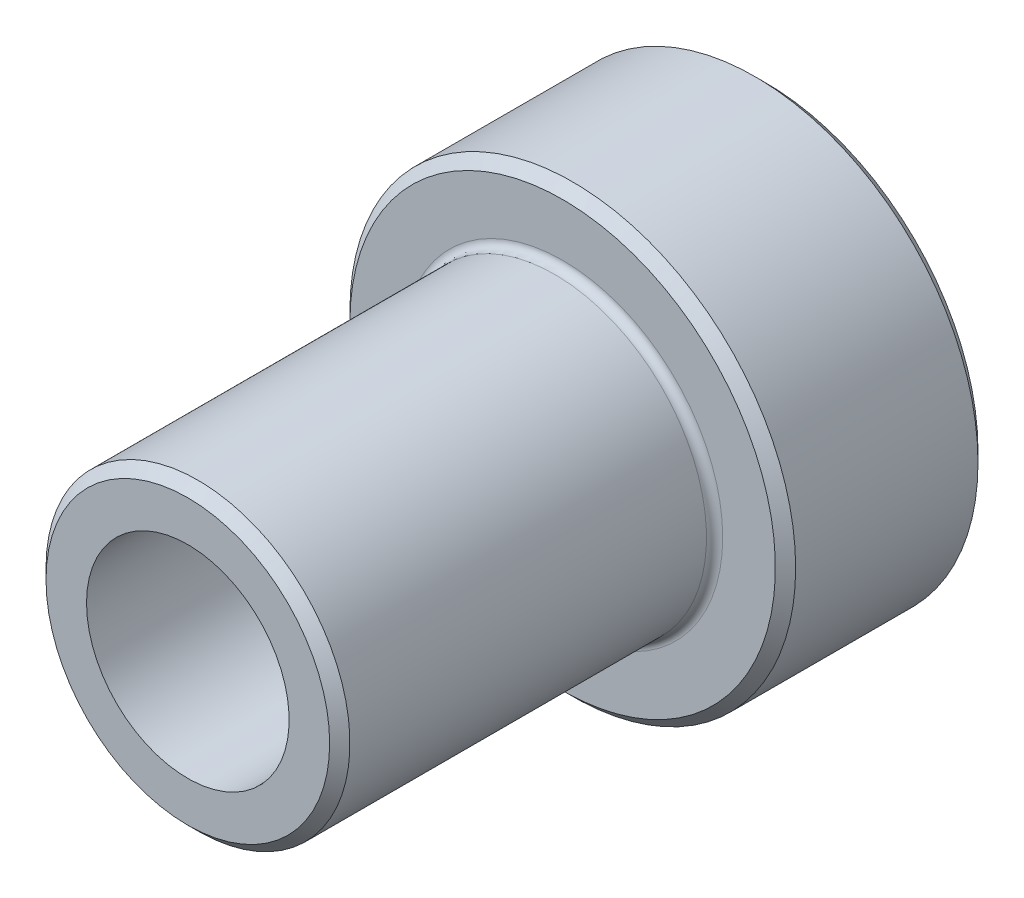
ISO-10303-21;
HEADER;
FILE_DESCRIPTION(('STEP AP214'),'2;1');
FILE_NAME('part.step','',(''),(''),'','','');
FILE_SCHEMA(('AUTOMOTIVE_DESIGN { 1 0 10303 214 1 1 1 1 }'));
ENDSEC;
DATA;
#1=APPLICATION_CONTEXT('core data for automotive mechanical design processes');
#2=APPLICATION_PROTOCOL_DEFINITION('international standard','automotive_design',2000,#1);
#3=PRODUCT_CONTEXT('',#1,'mechanical');
#4=PRODUCT('Part','Part','',(#3));
#5=PRODUCT_RELATED_PRODUCT_CATEGORY('part','',(#4));
#6=PRODUCT_DEFINITION_FORMATION('','',#4);
#7=PRODUCT_DEFINITION_CONTEXT('part definition',#1,'design');
#8=PRODUCT_DEFINITION('design','',#6,#7);
#9=PRODUCT_DEFINITION_SHAPE('','',#8);
#10=(LENGTH_UNIT() NAMED_UNIT(*) SI_UNIT(.MILLI.,.METRE.));
#11=(NAMED_UNIT(*) PLANE_ANGLE_UNIT() SI_UNIT($,.RADIAN.));
#12=(NAMED_UNIT(*) SI_UNIT($,.STERADIAN.) SOLID_ANGLE_UNIT());
#13=UNCERTAINTY_MEASURE_WITH_UNIT(LENGTH_MEASURE(1.E-05),#10,'distance_accuracy_value','');
#14=(GEOMETRIC_REPRESENTATION_CONTEXT(3) GLOBAL_UNCERTAINTY_ASSIGNED_CONTEXT((#13)) GLOBAL_UNIT_ASSIGNED_CONTEXT((#10,
#11,#12)) REPRESENTATION_CONTEXT('',''));
#15=CARTESIAN_POINT('',(0.,0.,0.));
#16=DIRECTION('',(0.,0.,1.));
#17=DIRECTION('',(1.,0.,0.));
#18=AXIS2_PLACEMENT_3D('',#15,#16,#17);
#19=CARTESIAN_POINT('',(0.,0.,0.));
#20=DIRECTION('',(0.,0.,1.));
#21=DIRECTION('',(1.,0.,0.));
#22=AXIS2_PLACEMENT_3D('',#19,#20,#21);
#23=PLANE('',#22);
#24=CARTESIAN_POINT('',(0.,0.,0.));
#25=DIRECTION('',(0.,0.,1.));
#26=DIRECTION('',(1.,0.,0.));
#27=AXIS2_PLACEMENT_3D('',#24,#25,#26);
#28=CIRCLE('',#27,10.5);
#29=CARTESIAN_POINT('',(10.5,0.,0.));
#30=VERTEX_POINT('',#29);
#31=EDGE_CURVE('E27',#30,#30,#28,.F.);
#32=ORIENTED_EDGE('',*,*,#31,.T.);
#33=EDGE_LOOP('',(#32));
#34=FACE_BOUND('',#33,.T.);
#35=CARTESIAN_POINT('',(0.,0.,0.));
#36=DIRECTION('',(0.,0.,-1.));
#37=DIRECTION('',(-1.,0.,0.));
#38=AXIS2_PLACEMENT_3D('',#35,#36,#37);
#39=CIRCLE('',#38,5.);
#40=CARTESIAN_POINT('',(-5.,0.,0.));
#41=VERTEX_POINT('',#40);
#42=EDGE_CURVE('E47',#41,#41,#39,.T.);
#43=ORIENTED_EDGE('',*,*,#42,.F.);
#44=EDGE_LOOP('',(#43));
#45=FACE_BOUND('',#44,.T.);
#46=ADVANCED_FACE('F12',(#34,#45),#23,.F.);
#47=CARTESIAN_POINT('',(0.,0.,28.5));
#48=DIRECTION('',(0.,0.,1.));
#49=DIRECTION('',(1.,0.,0.));
#50=AXIS2_PLACEMENT_3D('',#47,#48,#49);
#51=CYLINDRICAL_SURFACE('',#50,11.);
#52=CARTESIAN_POINT('',(0.,0.,0.499999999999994));
#53=DIRECTION('',(0.,0.,1.));
#54=DIRECTION('',(1.,0.,0.));
#55=AXIS2_PLACEMENT_3D('',#52,#53,#54);
#56=CIRCLE('',#55,11.);
#57=CARTESIAN_POINT('',(11.,0.,0.499999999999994));
#58=VERTEX_POINT('',#57);
#59=EDGE_CURVE('E32',#58,#58,#56,.T.);
#60=ORIENTED_EDGE('',*,*,#59,.T.);
#61=EDGE_LOOP('',(#60));
#62=FACE_BOUND('',#61,.T.);
#63=CARTESIAN_POINT('',(0.,0.,9.5));
#64=DIRECTION('',(0.,0.,-1.));
#65=DIRECTION('',(-1.,0.,0.));
#66=AXIS2_PLACEMENT_3D('',#63,#64,#65);
#67=CIRCLE('',#66,11.);
#68=CARTESIAN_POINT('',(-11.,0.,9.5));
#69=VERTEX_POINT('',#68);
#70=EDGE_CURVE('E35',#69,#69,#67,.T.);
#71=ORIENTED_EDGE('',*,*,#70,.T.);
#72=EDGE_LOOP('',(#71));
#73=FACE_BOUND('',#72,.T.);
#74=ADVANCED_FACE('F55',(#62,#73),#51,.T.);
#75=CARTESIAN_POINT('',(0.,11.,10.));
#76=DIRECTION('',(0.,0.,-1.));
#77=DIRECTION('',(-1.,0.,0.));
#78=AXIS2_PLACEMENT_3D('',#75,#76,#77);
#79=PLANE('',#78);
#80=CARTESIAN_POINT('',(0.,0.,10.));
#81=DIRECTION('',(0.,0.,-1.));
#82=DIRECTION('',(-1.,0.,0.));
#83=AXIS2_PLACEMENT_3D('',#80,#81,#82);
#84=CIRCLE('',#83,10.5);
#85=CARTESIAN_POINT('',(-10.5,0.,10.));
#86=VERTEX_POINT('',#85);
#87=EDGE_CURVE('E23',#86,#86,#84,.F.);
#88=ORIENTED_EDGE('',*,*,#87,.T.);
#89=EDGE_LOOP('',(#88));
#90=FACE_BOUND('',#89,.T.);
#91=CARTESIAN_POINT('',(0.,0.,10.));
#92=DIRECTION('',(0.,0.,-1.));
#93=DIRECTION('',(-1.,0.,0.));
#94=AXIS2_PLACEMENT_3D('',#91,#92,#93);
#95=CIRCLE('',#94,7.9);
#96=CARTESIAN_POINT('',(-7.9,0.,10.));
#97=VERTEX_POINT('',#96);
#98=EDGE_CURVE('E38',#97,#97,#95,.T.);
#99=ORIENTED_EDGE('',*,*,#98,.T.);
#100=EDGE_LOOP('',(#99));
#101=FACE_BOUND('',#100,.T.);
#102=ADVANCED_FACE('F63',(#90,#101),#79,.F.);
#103=CARTESIAN_POINT('',(0.,0.,28.5));
#104=DIRECTION('',(0.,0.,1.));
#105=DIRECTION('',(1.,0.,0.));
#106=AXIS2_PLACEMENT_3D('',#103,#104,#105);
#107=CYLINDRICAL_SURFACE('',#106,7.5);
#108=CARTESIAN_POINT('',(0.,0.,28.));
#109=DIRECTION('',(0.,0.,-1.));
#110=DIRECTION('',(-1.,0.,0.));
#111=AXIS2_PLACEMENT_3D('',#108,#109,#110);
#112=CIRCLE('',#111,7.5);
#113=CARTESIAN_POINT('',(-7.5,0.,28.));
#114=VERTEX_POINT('',#113);
#115=EDGE_CURVE('E8',#114,#114,#112,.T.);
#116=ORIENTED_EDGE('',*,*,#115,.T.);
#117=EDGE_LOOP('',(#116));
#118=FACE_BOUND('',#117,.T.);
#119=CARTESIAN_POINT('',(0.,0.,10.4));
#120=DIRECTION('',(0.,0.,-1.));
#121=DIRECTION('',(-1.,0.,0.));
#122=AXIS2_PLACEMENT_3D('',#119,#120,#121);
#123=CIRCLE('',#122,7.5);
#124=CARTESIAN_POINT('',(-7.5,0.,10.4));
#125=VERTEX_POINT('',#124);
#126=EDGE_CURVE('E41',#125,#125,#123,.F.);
#127=ORIENTED_EDGE('',*,*,#126,.T.);
#128=EDGE_LOOP('',(#127));
#129=FACE_BOUND('',#128,.T.);
#130=ADVANCED_FACE('F89',(#118,#129),#107,.T.);
#131=CARTESIAN_POINT('',(0.,7.5,28.5));
#132=DIRECTION('',(0.,0.,-1.));
#133=DIRECTION('',(-1.,0.,0.));
#134=AXIS2_PLACEMENT_3D('',#131,#132,#133);
#135=PLANE('',#134);
#136=CARTESIAN_POINT('',(0.,0.,28.5));
#137=DIRECTION('',(0.,0.,-1.));
#138=DIRECTION('',(-1.,0.,0.));
#139=AXIS2_PLACEMENT_3D('',#136,#137,#138);
#140=CIRCLE('',#139,7.);
#141=CARTESIAN_POINT('',(-7.,0.,28.5));
#142=VERTEX_POINT('',#141);
#143=EDGE_CURVE('E19',#142,#142,#140,.F.);
#144=ORIENTED_EDGE('',*,*,#143,.T.);
#145=EDGE_LOOP('',(#144));
#146=FACE_BOUND('',#145,.T.);
#147=CARTESIAN_POINT('',(0.,0.,28.5));
#148=DIRECTION('',(0.,0.,-1.));
#149=DIRECTION('',(-1.,0.,0.));
#150=AXIS2_PLACEMENT_3D('',#147,#148,#149);
#151=CIRCLE('',#150,5.);
#152=CARTESIAN_POINT('',(-5.,0.,28.5));
#153=VERTEX_POINT('',#152);
#154=EDGE_CURVE('E44',#153,#153,#151,.F.);
#155=ORIENTED_EDGE('',*,*,#154,.F.);
#156=EDGE_LOOP('',(#155));
#157=FACE_BOUND('',#156,.T.);
#158=ADVANCED_FACE('F95',(#146,#157),#135,.F.);
#159=CARTESIAN_POINT('',(0.,0.,28.501));
#160=DIRECTION('',(0.,0.,-1.));
#161=DIRECTION('',(-1.,0.,0.));
#162=AXIS2_PLACEMENT_3D('',#159,#160,#161);
#163=CYLINDRICAL_SURFACE('',#162,5.);
#164=ORIENTED_EDGE('',*,*,#42,.T.);
#165=EDGE_LOOP('',(#164));
#166=FACE_BOUND('',#165,.T.);
#167=ORIENTED_EDGE('',*,*,#154,.T.);
#168=EDGE_LOOP('',(#167));
#169=FACE_BOUND('',#168,.T.);
#170=ADVANCED_FACE('F51',(#166,#169),#163,.F.);
#171=CARTESIAN_POINT('',(0.,0.,10.4));
#172=DIRECTION('',(0.,0.,-1.));
#173=DIRECTION('',(-1.,0.,0.));
#174=AXIS2_PLACEMENT_3D('',#171,#172,#173);
#175=TOROIDAL_SURFACE('',#174,7.9,0.4);
#176=ORIENTED_EDGE('',*,*,#98,.F.);
#177=EDGE_LOOP('',(#176));
#178=FACE_BOUND('',#177,.T.);
#179=ORIENTED_EDGE('',*,*,#126,.F.);
#180=EDGE_LOOP('',(#179));
#181=FACE_BOUND('',#180,.T.);
#182=ADVANCED_FACE('F68',(#178,#181),#175,.F.);
#183=CARTESIAN_POINT('',(0.,0.,0.499999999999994));
#184=DIRECTION('',(0.,0.,1.));
#185=DIRECTION('',(1.,0.,0.));
#186=AXIS2_PLACEMENT_3D('',#183,#184,#185);
#187=CONICAL_SURFACE('',#186,11.,0.785398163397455);
#188=ORIENTED_EDGE('',*,*,#31,.F.);
#189=EDGE_LOOP('',(#188));
#190=FACE_BOUND('',#189,.T.);
#191=ORIENTED_EDGE('',*,*,#59,.F.);
#192=EDGE_LOOP('',(#191));
#193=FACE_BOUND('',#192,.T.);
#194=ADVANCED_FACE('F71',(#190,#193),#187,.T.);
#195=CARTESIAN_POINT('',(0.,0.,10.));
#196=DIRECTION('',(0.,0.,-1.));
#197=DIRECTION('',(-1.,0.,0.));
#198=AXIS2_PLACEMENT_3D('',#195,#196,#197);
#199=CONICAL_SURFACE('',#198,10.5,0.785398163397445);
#200=ORIENTED_EDGE('',*,*,#70,.F.);
#201=EDGE_LOOP('',(#200));
#202=FACE_BOUND('',#201,.T.);
#203=ORIENTED_EDGE('',*,*,#87,.F.);
#204=EDGE_LOOP('',(#203));
#205=FACE_BOUND('',#204,.T.);
#206=ADVANCED_FACE('F74',(#202,#205),#199,.T.);
#207=CARTESIAN_POINT('',(0.,0.,28.5));
#208=DIRECTION('',(0.,0.,-1.));
#209=DIRECTION('',(-1.,0.,0.));
#210=AXIS2_PLACEMENT_3D('',#207,#208,#209);
#211=CONICAL_SURFACE('',#210,7.,0.785398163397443);
#212=ORIENTED_EDGE('',*,*,#115,.F.);
#213=EDGE_LOOP('',(#212));
#214=FACE_BOUND('',#213,.T.);
#215=ORIENTED_EDGE('',*,*,#143,.F.);
#216=EDGE_LOOP('',(#215));
#217=FACE_BOUND('',#216,.T.);
#218=ADVANCED_FACE('F14',(#214,#217),#211,.T.);
#219=CLOSED_SHELL('',(#46,#74,#102,#130,#158,#170,#182,#194,#206,#218));
#220=MANIFOLD_SOLID_BREP('B1',#219);
#221=ADVANCED_BREP_SHAPE_REPRESENTATION('',(#18,#220),#14);
#222=SHAPE_DEFINITION_REPRESENTATION(#9,#221);
ENDSEC;
END-ISO-10303-21;
